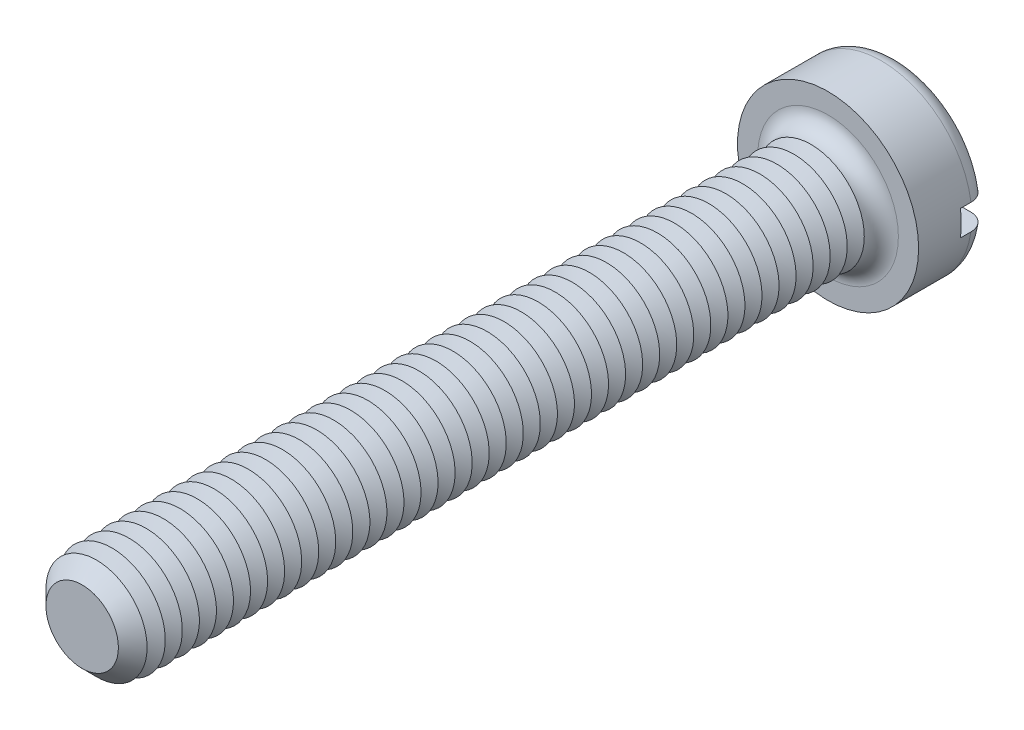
from build123d import *

# Parameters (mm, degrees)
SKETCH3_R           = 4.25
BOSS_EXTRUDE2_DEPTH = 3.3
SKETCH4_R           = 2.5
BOSS_EXTRUDE3_DEPTH = 35
FILLET1_R           = 0.8
CHAMFER1_SIZE       = 0.8
LPATTERN1_COUNT     = 42
LPATTERN1_PITCH     = 0.8
SKETCH8_W           = 8.5
SKETCH8_H           = 1.2
CUT_EXTRUDE1_DEPTH  = 1.3


with BuildPart() as part:
    # Sketch3 → Boss-Extrude2 (new body)
    with BuildSketch(Plane.XY):
        Circle(SKETCH3_R)
    extrude(amount=-BOSS_EXTRUDE2_DEPTH)

    # Sketch4 → Boss-Extrude3 (add)
    with BuildSketch(Plane.XY):
        Circle(SKETCH4_R)
    extrude(amount=BOSS_EXTRUDE3_DEPTH)

    # Fillet1
    fillet1_edges = [part.edges().sort_by_distance(p)[0] for p in [
        (-4.25, 0, -3.3),
        (-2.5, 0, 0),
    ]]
    fillet(fillet1_edges, radius=FILLET1_R)

    # Chamfer1
    chamfer1_edges = [part.edges().sort_by_distance(p)[0] for p in [
        (-2.5, 0, 35),
    ]]
    chamfer(chamfer1_edges, length=CHAMFER1_SIZE)

    # Sketch6 → Cut-Revolve1 (revolve, cut)
    with BuildSketch(Plane(origin=(0, 0, 0), x_dir=(0, 0, -1), z_dir=(1, 0, 0)), mode=Mode.PRIVATE) as cut_revolve1_sk:
        Polygon((-0.8, 2.5), (-1.2, 1.807179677), (-1.6, 2.5), align=None)
    cut_revolve1 = revolve(cut_revolve1_sk.sketch.rotate(Axis((0, 0, -1.694361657), (0, 0, 1)), 90), axis=Axis((0, 0, -1.694361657), (0, 0, 1)), mode=Mode.SUBTRACT)

    # LPattern1: Cut-Revolve1 ×42
    with Locations(*[(0, 0, i * LPATTERN1_PITCH) for i in range(1, LPATTERN1_COUNT)]):
        add(cut_revolve1, mode=Mode.SUBTRACT)

    # Sketch8 → Cut-Extrude1 (cut)
    with BuildSketch(Plane(origin=(0, 0, -3.3), x_dir=(-1, 0, 0), z_dir=(0, 0, -1))):
        Rectangle(SKETCH8_W, SKETCH8_H)
    extrude(amount=-CUT_EXTRUDE1_DEPTH, mode=Mode.SUBTRACT)


solid = part.part
